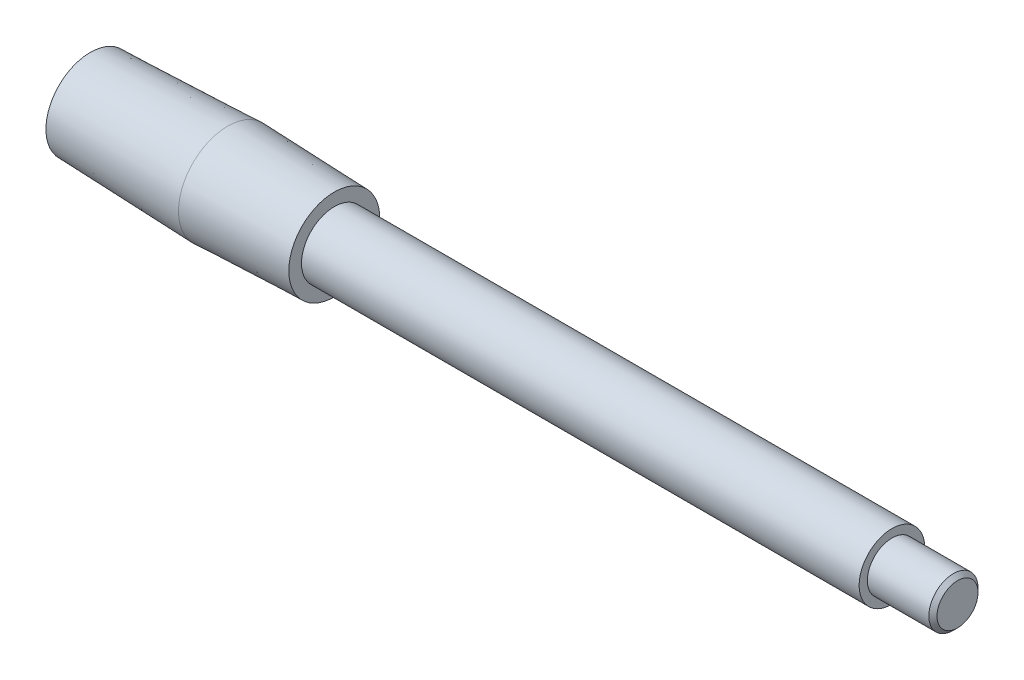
ISO-10303-21;
HEADER;
FILE_DESCRIPTION(('STEP AP214'),'2;1');
FILE_NAME('part.step','',(''),(''),'','','');
FILE_SCHEMA(('AUTOMOTIVE_DESIGN { 1 0 10303 214 1 1 1 1 }'));
ENDSEC;
DATA;
#1=APPLICATION_CONTEXT('core data for automotive mechanical design processes');
#2=APPLICATION_PROTOCOL_DEFINITION('international standard','automotive_design',2000,#1);
#3=PRODUCT_CONTEXT('',#1,'mechanical');
#4=PRODUCT('Part','Part','',(#3));
#5=PRODUCT_RELATED_PRODUCT_CATEGORY('part','',(#4));
#6=PRODUCT_DEFINITION_FORMATION('','',#4);
#7=PRODUCT_DEFINITION_CONTEXT('part definition',#1,'design');
#8=PRODUCT_DEFINITION('design','',#6,#7);
#9=PRODUCT_DEFINITION_SHAPE('','',#8);
#10=(LENGTH_UNIT() NAMED_UNIT(*) SI_UNIT(.MILLI.,.METRE.));
#11=(NAMED_UNIT(*) PLANE_ANGLE_UNIT() SI_UNIT($,.RADIAN.));
#12=(NAMED_UNIT(*) SI_UNIT($,.STERADIAN.) SOLID_ANGLE_UNIT());
#13=UNCERTAINTY_MEASURE_WITH_UNIT(LENGTH_MEASURE(1.E-05),#10,'distance_accuracy_value','');
#14=(GEOMETRIC_REPRESENTATION_CONTEXT(3) GLOBAL_UNCERTAINTY_ASSIGNED_CONTEXT((#13)) GLOBAL_UNIT_ASSIGNED_CONTEXT((#10,
#11,#12)) REPRESENTATION_CONTEXT('',''));
#15=CARTESIAN_POINT('',(0.,0.,0.));
#16=DIRECTION('',(0.,0.,1.));
#17=DIRECTION('',(1.,0.,0.));
#18=AXIS2_PLACEMENT_3D('',#15,#16,#17);
#19=CARTESIAN_POINT('',(8.,3.,0.));
#20=DIRECTION('',(1.,0.,0.));
#21=DIRECTION('',(0.,0.,-1.));
#22=AXIS2_PLACEMENT_3D('',#19,#20,#21);
#23=PLANE('',#22);
#24=CARTESIAN_POINT('',(8.0000000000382,0.,0.));
#25=DIRECTION('',(-1.,0.,0.));
#26=DIRECTION('',(0.,0.,1.));
#27=AXIS2_PLACEMENT_3D('',#24,#25,#26);
#28=CIRCLE('',#27,2.49999999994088);
#29=CARTESIAN_POINT('',(8.0000000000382,0.,2.49999999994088));
#30=VERTEX_POINT('',#29);
#31=EDGE_CURVE('E19',#30,#30,#28,.T.);
#32=ORIENTED_EDGE('',*,*,#31,.F.);
#33=EDGE_LOOP('',(#32));
#34=FACE_BOUND('',#33,.T.);
#35=ADVANCED_FACE('F15',(#34),#23,.T.);
#36=CARTESIAN_POINT('',(-78.5,0.,0.));
#37=DIRECTION('',(0.506894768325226,0.629445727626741,0.588944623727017));
#38=DIRECTION('',(-0.856919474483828,0.442080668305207,0.265054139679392));
#39=AXIS2_PLACEMENT_3D('',#36,#37,#38);
#40=SPHERICAL_SURFACE('',#39,20.);
#41=CARTESIAN_POINT('',(-97.7530017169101,0.,0.));
#42=DIRECTION('',(1.,0.,0.));
#43=DIRECTION('',(0.,0.,-1.));
#44=AXIS2_PLACEMENT_3D('',#41,#42,#43);
#45=CIRCLE('',#44,5.41497228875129);
#46=CARTESIAN_POINT('',(-97.7530017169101,0.,-5.41497228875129));
#47=VERTEX_POINT('',#46);
#48=EDGE_CURVE('E39',#47,#47,#45,.T.);
#49=ORIENTED_EDGE('',*,*,#48,.F.);
#50=EDGE_LOOP('',(#49));
#51=FACE_BOUND('',#50,.T.);
#52=ADVANCED_FACE('F50',(#51),#40,.T.);
#53=CARTESIAN_POINT('',(7.49999999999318,0.,0.));
#54=DIRECTION('',(-1.,0.,0.));
#55=DIRECTION('',(0.,0.,1.));
#56=AXIS2_PLACEMENT_3D('',#53,#54,#55);
#57=CONICAL_SURFACE('',#56,2.9999999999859,0.785398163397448);
#58=CARTESIAN_POINT('',(7.5,0.,0.));
#59=DIRECTION('',(1.,0.,0.));
#60=DIRECTION('',(0.,1.,0.));
#61=AXIS2_PLACEMENT_3D('',#58,#59,#60);
#62=CIRCLE('',#61,3.);
#63=CARTESIAN_POINT('',(7.5,3.,0.));
#64=VERTEX_POINT('',#63);
#65=EDGE_CURVE('E31',#64,#64,#62,.T.);
#66=ORIENTED_EDGE('',*,*,#65,.T.);
#67=EDGE_LOOP('',(#66));
#68=FACE_BOUND('',#67,.T.);
#69=ORIENTED_EDGE('',*,*,#31,.T.);
#70=EDGE_LOOP('',(#69));
#71=FACE_BOUND('',#70,.T.);
#72=ADVANCED_FACE('F47',(#68,#71),#57,.T.);
#73=CARTESIAN_POINT('',(-81.000000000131,0.,0.));
#74=DIRECTION('',(1.,0.,0.));
#75=DIRECTION('',(0.,0.,-1.));
#76=AXIS2_PLACEMENT_3D('',#73,#74,#75);
#77=CONICAL_SURFACE('',#76,6.00000000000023,0.0349065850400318);
#78=ORIENTED_EDGE('',*,*,#48,.T.);
#79=EDGE_LOOP('',(#78));
#80=FACE_BOUND('',#79,.T.);
#81=CARTESIAN_POINT('',(-81.0000000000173,0.,0.));
#82=DIRECTION('',(-1.,0.,0.));
#83=DIRECTION('',(0.,1.,0.));
#84=AXIS2_PLACEMENT_3D('',#81,#82,#83);
#85=CIRCLE('',#84,6.00000000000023);
#86=CARTESIAN_POINT('',(-81.0000000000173,6.00000000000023,0.));
#87=VERTEX_POINT('',#86);
#88=EDGE_CURVE('E38',#87,#87,#85,.F.);
#89=ORIENTED_EDGE('',*,*,#88,.F.);
#90=EDGE_LOOP('',(#89));
#91=FACE_BOUND('',#90,.T.);
#92=ADVANCED_FACE('F83',(#80,#91),#77,.T.);
#93=CARTESIAN_POINT('',(7.5,0.,0.));
#94=DIRECTION('',(-1.,0.,0.));
#95=DIRECTION('',(0.,0.,1.));
#96=AXIS2_PLACEMENT_3D('',#93,#94,#95);
#97=CYLINDRICAL_SURFACE('',#96,3.);
#98=ORIENTED_EDGE('',*,*,#65,.F.);
#99=EDGE_LOOP('',(#98));
#100=FACE_BOUND('',#99,.T.);
#101=CARTESIAN_POINT('',(0.,0.,0.));
#102=DIRECTION('',(-1.,0.,0.));
#103=DIRECTION('',(0.,0.,1.));
#104=AXIS2_PLACEMENT_3D('',#101,#102,#103);
#105=CIRCLE('',#104,3.);
#106=CARTESIAN_POINT('',(0.,0.,3.));
#107=VERTEX_POINT('',#106);
#108=EDGE_CURVE('E36',#107,#107,#105,.F.);
#109=ORIENTED_EDGE('',*,*,#108,.T.);
#110=EDGE_LOOP('',(#109));
#111=FACE_BOUND('',#110,.T.);
#112=ADVANCED_FACE('F76',(#100,#111),#97,.T.);
#113=CARTESIAN_POINT('',(-80.9999999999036,0.,0.));
#114=DIRECTION('',(-1.,0.,0.));
#115=DIRECTION('',(0.,0.,1.));
#116=AXIS2_PLACEMENT_3D('',#113,#114,#115);
#117=CONICAL_SURFACE('',#116,5.99999999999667,0.0349065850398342);
#118=ORIENTED_EDGE('',*,*,#88,.T.);
#119=EDGE_LOOP('',(#118));
#120=FACE_BOUND('',#119,.T.);
#121=CARTESIAN_POINT('',(-67.9999999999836,0.,0.));
#122=DIRECTION('',(-1.,0.,0.));
#123=DIRECTION('',(0.,0.,1.));
#124=AXIS2_PLACEMENT_3D('',#121,#122,#123);
#125=CIRCLE('',#124,5.54602999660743);
#126=CARTESIAN_POINT('',(-67.9999999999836,0.,5.54602999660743));
#127=VERTEX_POINT('',#126);
#128=EDGE_CURVE('E28',#127,#127,#125,.T.);
#129=ORIENTED_EDGE('',*,*,#128,.T.);
#130=EDGE_LOOP('',(#129));
#131=FACE_BOUND('',#130,.T.);
#132=ADVANCED_FACE('F70',(#120,#131),#117,.T.);
#133=CARTESIAN_POINT('',(0.,4.5,0.));
#134=DIRECTION('',(-1.,0.,0.));
#135=DIRECTION('',(0.,0.,1.));
#136=AXIS2_PLACEMENT_3D('',#133,#134,#135);
#137=PLANE('',#136);
#138=ORIENTED_EDGE('',*,*,#108,.F.);
#139=EDGE_LOOP('',(#138));
#140=FACE_BOUND('',#139,.T.);
#141=CARTESIAN_POINT('',(0.,0.,0.));
#142=DIRECTION('',(-1.,0.,0.));
#143=DIRECTION('',(0.,0.,1.));
#144=AXIS2_PLACEMENT_3D('',#141,#142,#143);
#145=CIRCLE('',#144,4.);
#146=CARTESIAN_POINT('',(0.,0.,4.));
#147=VERTEX_POINT('',#146);
#148=EDGE_CURVE('E23',#147,#147,#145,.F.);
#149=ORIENTED_EDGE('',*,*,#148,.T.);
#150=EDGE_LOOP('',(#149));
#151=FACE_BOUND('',#150,.T.);
#152=ADVANCED_FACE('F64',(#140,#151),#137,.F.);
#153=CARTESIAN_POINT('',(-68.,4.99999999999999,0.));
#154=DIRECTION('',(-1.,0.,0.));
#155=DIRECTION('',(0.,0.,1.));
#156=AXIS2_PLACEMENT_3D('',#153,#154,#155);
#157=PLANE('',#156);
#158=ORIENTED_EDGE('',*,*,#128,.F.);
#159=EDGE_LOOP('',(#158));
#160=FACE_BOUND('',#159,.T.);
#161=CARTESIAN_POINT('',(-68.,0.,0.));
#162=DIRECTION('',(-1.,0.,0.));
#163=DIRECTION('',(0.,0.,1.));
#164=AXIS2_PLACEMENT_3D('',#161,#162,#163);
#165=CIRCLE('',#164,4.);
#166=CARTESIAN_POINT('',(-68.,0.,4.));
#167=VERTEX_POINT('',#166);
#168=EDGE_CURVE('E10',#167,#167,#165,.T.);
#169=ORIENTED_EDGE('',*,*,#168,.T.);
#170=EDGE_LOOP('',(#169));
#171=FACE_BOUND('',#170,.T.);
#172=ADVANCED_FACE('F59',(#160,#171),#157,.F.);
#173=CARTESIAN_POINT('',(0.,0.,0.));
#174=DIRECTION('',(-1.,0.,0.));
#175=DIRECTION('',(0.,0.,1.));
#176=AXIS2_PLACEMENT_3D('',#173,#174,#175);
#177=CYLINDRICAL_SURFACE('',#176,4.);
#178=ORIENTED_EDGE('',*,*,#168,.F.);
#179=EDGE_LOOP('',(#178));
#180=FACE_BOUND('',#179,.T.);
#181=ORIENTED_EDGE('',*,*,#148,.F.);
#182=EDGE_LOOP('',(#181));
#183=FACE_BOUND('',#182,.T.);
#184=ADVANCED_FACE('F17',(#180,#183),#177,.T.);
#185=CLOSED_SHELL('',(#35,#52,#72,#92,#112,#132,#152,#172,#184));
#186=MANIFOLD_SOLID_BREP('B1',#185);
#187=ADVANCED_BREP_SHAPE_REPRESENTATION('',(#18,#186),#14);
#188=SHAPE_DEFINITION_REPRESENTATION(#9,#187);
ENDSEC;
END-ISO-10303-21;
